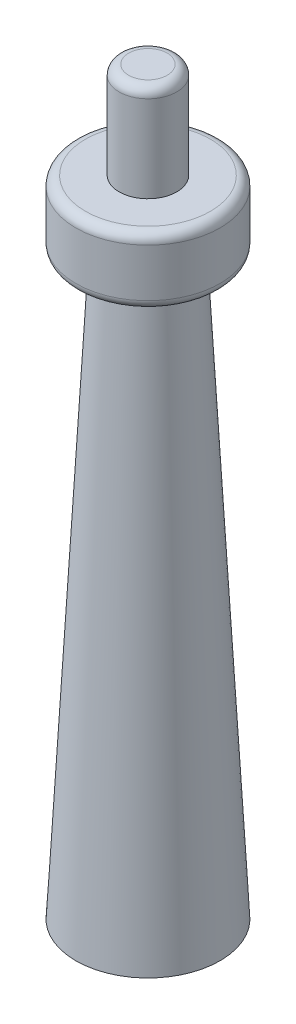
from build123d import *

# Parameters (mm, degrees)
ESQUISSE1_R        = 750
BOSS_EXTRU_1_DEPTH = 6000
BOSS_EXTRU_1_TAPER = 3
ESQUISSE2_R        = 750
BOSS_EXTRU_2_DEPTH = 700
CONG_1_R           = 100
CONG_2_R           = 100
CONG_3_R           = 100
ESQUISSE3_R        = 300
BOSS_EXTRU_3_DEPTH = 1000
CONG_4_R           = 100


with BuildPart() as part:
    # Esquisse1 → Boss.-Extru.1 (new body)
    with BuildSketch(Plane(origin=(0, 0, 0), x_dir=(1, 0, 0), z_dir=(0, 1, 0))):
        Circle(ESQUISSE1_R)
    extrude(amount=BOSS_EXTRU_1_DEPTH, taper=BOSS_EXTRU_1_TAPER)

    # Esquisse2 → Boss.-Extru.2 (add)
    with BuildSketch(Plane(origin=(0, 6000, 0), x_dir=(1, 0, 0), z_dir=(0, 1, 0))):
        with Locations(Location((0, 0, 0), (0, 0, 270))):
            Circle(ESQUISSE2_R)
    extrude(amount=BOSS_EXTRU_2_DEPTH)

    # Cong_1
    cong_1_edges = [part.edges().sort_by_distance(p)[0] for p in [
        (-435.553324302, 6000, 0),
    ]]
    fillet(cong_1_edges, radius=CONG_1_R)

    # Cong_2
    cong_2_edges = [part.edges().sort_by_distance(p)[0] for p in [
        (0, 6000, -750),
    ]]
    fillet(cong_2_edges, radius=CONG_2_R)

    # Cong_3
    cong_3_edges = [part.edges().sort_by_distance(p)[0] for p in [
        (0, 6700, -750),
    ]]
    fillet(cong_3_edges, radius=CONG_3_R)

    # Esquisse3 → Boss.-Extru.3 (add)
    with BuildSketch(Plane(origin=(0, 6700, 0), x_dir=(1, 0, 0), z_dir=(0, 1, 0))):
        with Locations(Location((0, 0, 0), (0, 0, 270))):
            Circle(ESQUISSE3_R)
    extrude(amount=BOSS_EXTRU_3_DEPTH)

    # Cong_4
    cong_4_edges = [part.edges().sort_by_distance(p)[0] for p in [
        (0, 7700, -300),
    ]]
    fillet(cong_4_edges, radius=CONG_4_R)


solid = part.part
